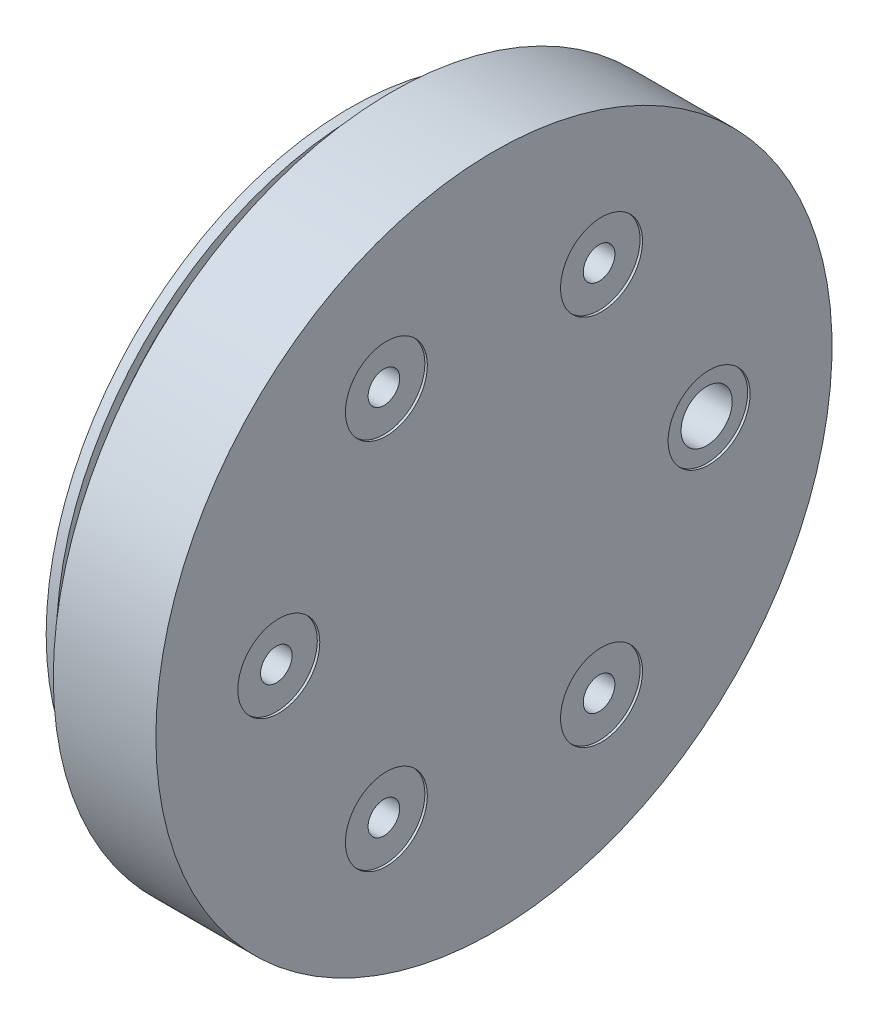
from build123d import *

# Parameters (mm, degrees)
SKETCH3_R                         = 5.7531
CUT_EXTRUDE1_DEPTH                = 155.709793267
SKETCH4_R                         = 12.7
CUT_EXTRUDE2_DEPTH                = 0.762
CIRPATTERN2_COUNT                 = 6
SKETCH7_R                         = 2.413
CUT_EXTRUDE5_DEPTH                = 9.525
SKETCH5_R                         = 4.9022
CUT_EXTRUDE6_DEPTH                = 155.492379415
CIRPATTERN3_COUNT                 = 5
CIRPATTERN3_ANGLE                 = 240
F_5_8_18_TAPPED_HOLE1_D           = 14.68374
F_5_8_18_TAPPED_HOLE1_DEPTH       = 35.9918
F_5_8_18_TAPPED_HOLE1_CBORE_D     = 15.875
F_5_8_18_TAPPED_HOLE1_CBORE_DEPTH = 31.75
F_5_8_18_TAPPED_HOLE1_TIP         = 4.411440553


with BuildPart() as part:
    # Sketch1 → Base-Revolve (revolve)
    with BuildSketch(Plane.XY, mode=Mode.PRIVATE) as base_revolve_sk:
        Polygon((0, 0), (0, 94.2848), (3.175, 94.2848), (3.175, 91.44), (7.493, 91.44), (7.493, 94.2848), (12.7, 94.2848), (12.7, 96.52), (15.5448, 96.52), (15.5448, 100.838), (12.7, 100.838), (12.7, 104.775), (44.491784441, 104.775), (44.491784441, 0), align=None)
    revolve(base_revolve_sk.sketch.rotate(Axis((-90.978930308, 0, 0), (1, 0, 0)), 90), axis=Axis((-90.978930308, 0, 0), (1, 0, 0)))

    # Sketch3 → Cut-Extrude1 (cut, through all)
    with BuildSketch(Plane(origin=(44.491784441, 0, 0), x_dir=(0, 0, -1), z_dir=(1, 0, 0))):
        with Locations((66.675, 0)):
            Circle(SKETCH3_R)
    extrude(amount=-CUT_EXTRUDE1_DEPTH, mode=Mode.SUBTRACT)

    # Sketch4 → Cut-Extrude2 (cut)
    with BuildSketch(Plane(origin=(44.491784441, 0, 0), x_dir=(0, 0, -1), z_dir=(1, 0, 0))):
        with Locations((66.675, 0)):
            Circle(SKETCH4_R)
    cut_extrude2 = extrude(amount=-CUT_EXTRUDE2_DEPTH, mode=Mode.SUBTRACT)

    # CirPattern2: Cut-Extrude2 ×6 about axis
    cirpattern2_axis = Axis((0, 0, 0), (1, 0, 0))
    for i in range(1, CIRPATTERN2_COUNT):
        add(cut_extrude2.rotate(cirpattern2_axis, i * 360 / CIRPATTERN2_COUNT), mode=Mode.SUBTRACT)

    # Sketch7 → Cut-Extrude5 (cut)
    with BuildSketch(Plane.ZY):
        with Locations((58.42, -59.69)):
            Circle(SKETCH7_R)
        with Locations((-58.42, -59.69)):
            Circle(SKETCH7_R)
        with Locations((58.42, 59.69)):
            Circle(SKETCH7_R)
        with Locations((-58.42, 59.69)):
            Circle(SKETCH7_R)
    extrude(amount=-CUT_EXTRUDE5_DEPTH, mode=Mode.SUBTRACT)

    # Sketch5 → Cut-Extrude6 (cut, through all)
    with BuildSketch(Plane(origin=(43.729784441, 0, 0), x_dir=(0, 0, -1), z_dir=(1, 0, 0))):
        with Locations((33.3375, 57.742243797)):
            Circle(SKETCH5_R)
    cut_extrude6 = extrude(amount=-CUT_EXTRUDE6_DEPTH, mode=Mode.SUBTRACT)

    # CirPattern3: Cut-Extrude6 ×5 about axis
    cirpattern3_axis = Axis((0, 0, 0), (1, 0, 0))
    for i in range(1, CIRPATTERN3_COUNT):
        add(cut_extrude6.rotate(cirpattern3_axis, i * CIRPATTERN3_ANGLE / (CIRPATTERN3_COUNT - 1)), mode=Mode.SUBTRACT)

    # 5_8-18 Tapped Hole1
    with Locations(Plane(origin=(43.729784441, 0, 0), x_dir=(0, 0, -1), z_dir=(1, 0, 0))):
        with Locations((66.675, 0)):
            CounterBoreHole(F_5_8_18_TAPPED_HOLE1_D / 2, F_5_8_18_TAPPED_HOLE1_CBORE_D / 2, F_5_8_18_TAPPED_HOLE1_CBORE_DEPTH, depth=F_5_8_18_TAPPED_HOLE1_DEPTH)
            with Locations((0, 0, -(F_5_8_18_TAPPED_HOLE1_DEPTH + F_5_8_18_TAPPED_HOLE1_TIP / 2))):  # 118° drill point
                Cone(0, F_5_8_18_TAPPED_HOLE1_D / 2, F_5_8_18_TAPPED_HOLE1_TIP, mode=Mode.SUBTRACT)


solid = part.part
